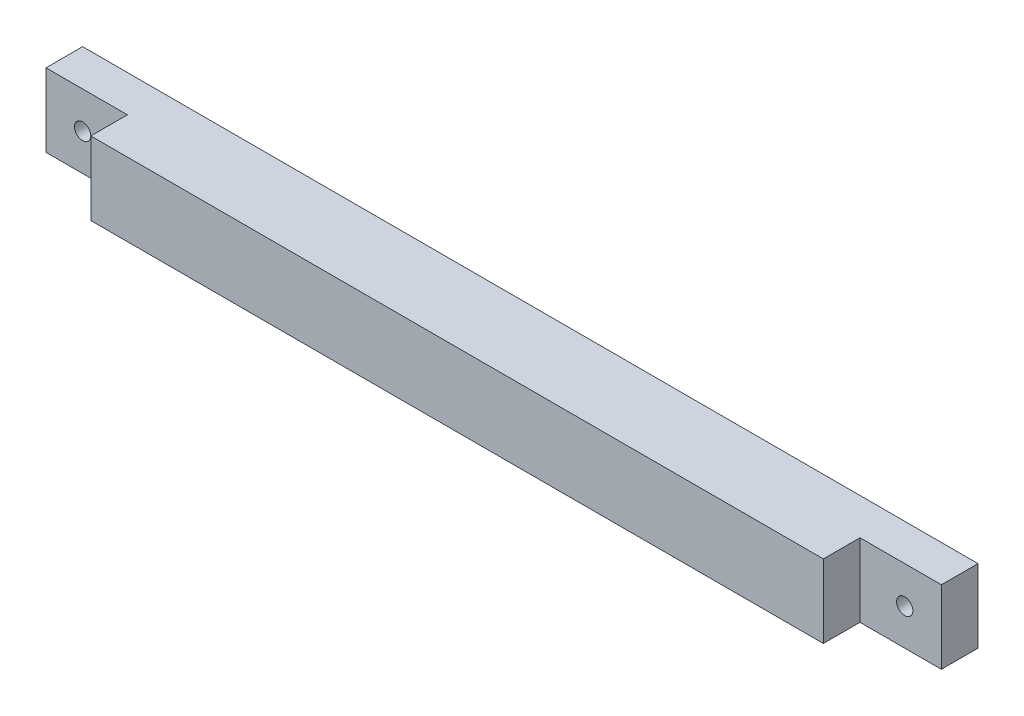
from build123d import *

# Parameters (mm, degrees)
ESQUISSE1_W             = 110
ESQUISSE1_H             = 9
EXTRUSION1_DEPTH        = 9
ESQUISSE2_W             = 10
ESQUISSE2_H             = 9
ENL_V_MAT_EXTRU_1_DEPTH = 4.5
ESQUISSE4_R             = 1
ENL_V_MAT_EXTRU_2_DEPTH = 4.5
ESQUISSE5_R             = 1
ENL_V_MAT_EXTRU_3_DEPTH = 4.5


with BuildPart() as part:
    # Esquisse1 → Extrusion1 (new body)
    with BuildSketch(Plane.XY):
        with Locations((-12.271684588, -105.117562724)):
            Rectangle(ESQUISSE1_W, ESQUISSE1_H)
    extrude(amount=EXTRUSION1_DEPTH)

    # Esquisse2 → Enl_v. mat.-Extru.1 (cut)
    with BuildSketch(Plane.XY.offset(9)):
        with Locations((-62.271684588, -105.117562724)):
            Rectangle(ESQUISSE2_W, ESQUISSE2_H)
        with Locations((37.728315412, -105.117562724)):
            Rectangle(ESQUISSE2_W, ESQUISSE2_H)
    extrude(amount=-ENL_V_MAT_EXTRU_1_DEPTH, mode=Mode.SUBTRACT)

    # Esquisse4 → Enl_v. mat.-Extru.2 (cut)
    with BuildSketch(Plane.XY.offset(4.5)):
        with Locations((38.22840174, -105.145436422)):
            Circle(ESQUISSE4_R)
    extrude(amount=-ENL_V_MAT_EXTRU_2_DEPTH, mode=Mode.SUBTRACT)

    # Esquisse5 → Enl_v. mat.-Extru.3 (cut)
    with BuildSketch(Plane.XY.offset(4.5)):
        with Locations((-62.771684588, -105.117562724)):
            Circle(ESQUISSE5_R)
    extrude(amount=-ENL_V_MAT_EXTRU_3_DEPTH, mode=Mode.SUBTRACT)


solid = part.part
